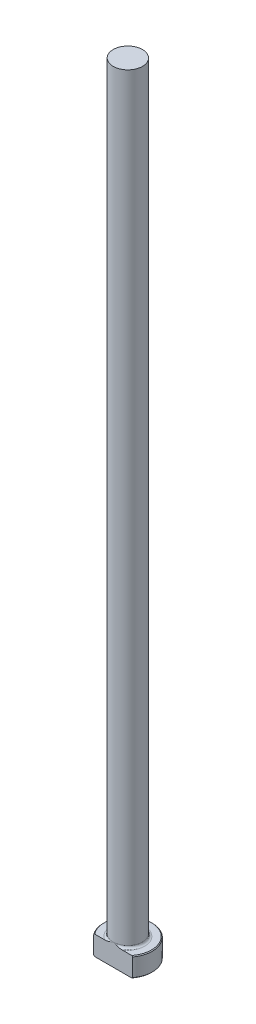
from build123d import *

# Parameters (mm, degrees)
CHAMFER1_SIZE = 0.254
FILLET1_R     = 0.762
KEY_DEPTH     = 255.247925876


with BuildPart() as part:
    # Sketch1 → Revolve1 (revolve)
    with BuildSketch(Plane.XY, mode=Mode.PRIVATE) as revolve1_sk:
        Polygon((0, 0), (-7.9375, 0), (-7.9375, 6.35), (-4.7625, 6.35), (-4.7625, 254), (0, 254), align=None)
    revolve(revolve1_sk.sketch.rotate(Axis((0, 259.958771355, 0), (0, -1, 0)), 270), axis=Axis((0, 259.958771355, 0), (0, -1, 0)))

    # Chamfer1
    chamfer1_edges = [part.edges().sort_by_distance(p)[0] for p in [
        (0, 6.35, -7.9375),
        (0, 0, -7.9375),
    ]]
    chamfer(chamfer1_edges, length=CHAMFER1_SIZE)

    # Fillet1
    fillet1_edges = [part.edges().sort_by_distance(p)[0] for p in [
        (0, 6.35, -4.7625),
    ]]
    fillet(fillet1_edges, radius=FILLET1_R)

    # Sketch2 → KEY (cut, through all)
    with BuildSketch(Plane.XZ):
        with BuildLine():
            Line((-6.35, 4.7625), (6.35, 4.7625))
            ThreePointArc((6.35, 4.7625), (0, 7.9375), (-6.35, 4.7625))
        make_face()
    extrude(amount=-KEY_DEPTH, mode=Mode.SUBTRACT)


solid = part.part
